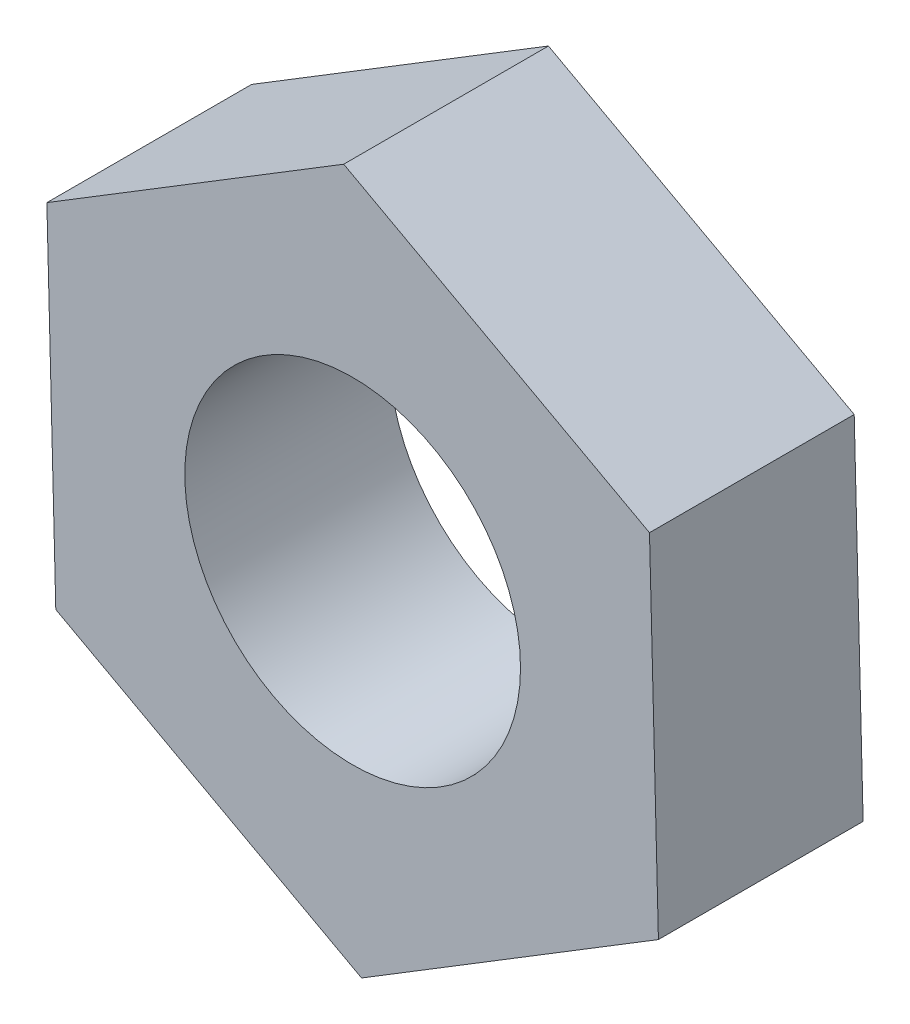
from build123d import *

# Parameters (mm, degrees)
SKETCH1_R      = 5.207
EXTRUDE1_DEPTH = 6.35


with BuildPart() as part:
    # Sketch1 → Extrude1 (new body)
    with BuildSketch(Plane.XY):
        Polygon((9.207774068, 5.635792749), (-0.276852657, 10.79206263), (-9.484626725, 5.156269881), (-9.207774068, -5.635792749), (0.276852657, -10.79206263), (9.484626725, -5.156269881), align=None)
        Circle(SKETCH1_R, mode=Mode.SUBTRACT)
    extrude(amount=EXTRUDE1_DEPTH)


solid = part.part
